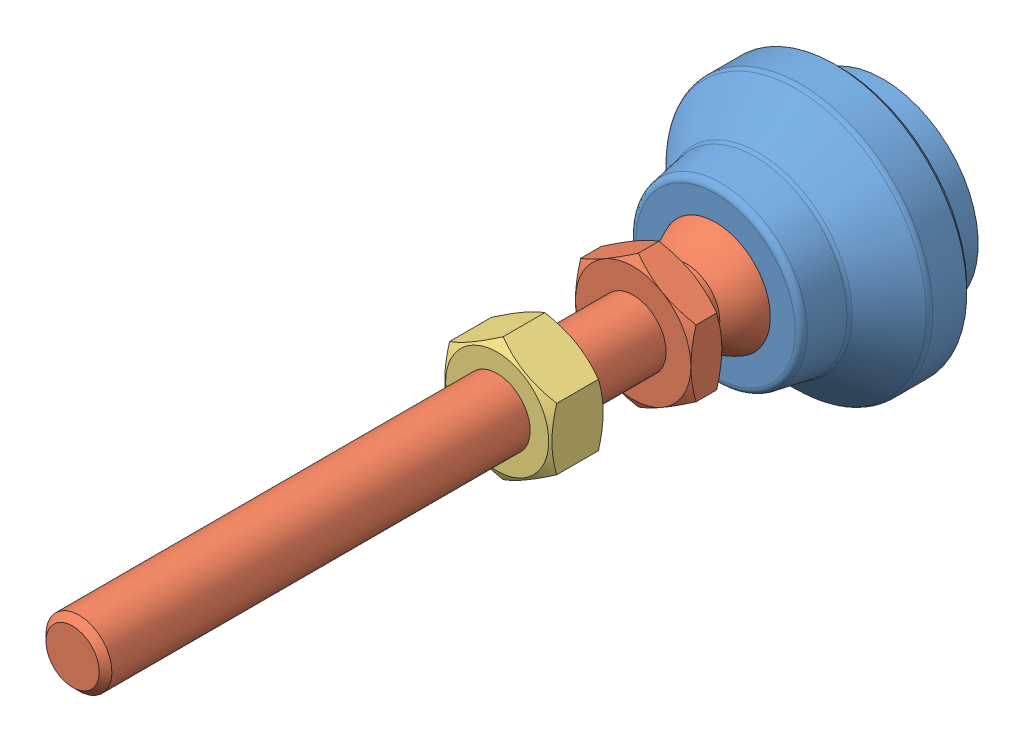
SolidWorks assembly LSVA32-M8X68-SUS.sldasm, configuration Default (file format 15000). Lengths in mm.
Overall size (32 32 98.3).
3 component instances, 3 part files, 0 mates.
Components (placement in the parent):
- LSVA32-M8X68-SUS_01-2: LSVA32-M8X68-SUS_01.sldprt [Default] at (0 0 5.3) x (1 0 0) z (0 -1 0) size (32 20.3 32)
- LSVA32-M8X68-SUS_02-1: LSVA32-M8X68-SUS_02.sldprt [Default] at (0 0 18.05) x (1 0 0) z (0 -1 0) size (14 87.25 16.17)
- LSVA32-M8X68-SUS_03-1: LSVA32-M8X68-SUS_03.sldprt [Default] at (0 0 40.3) size (13 15.01 6.5)
